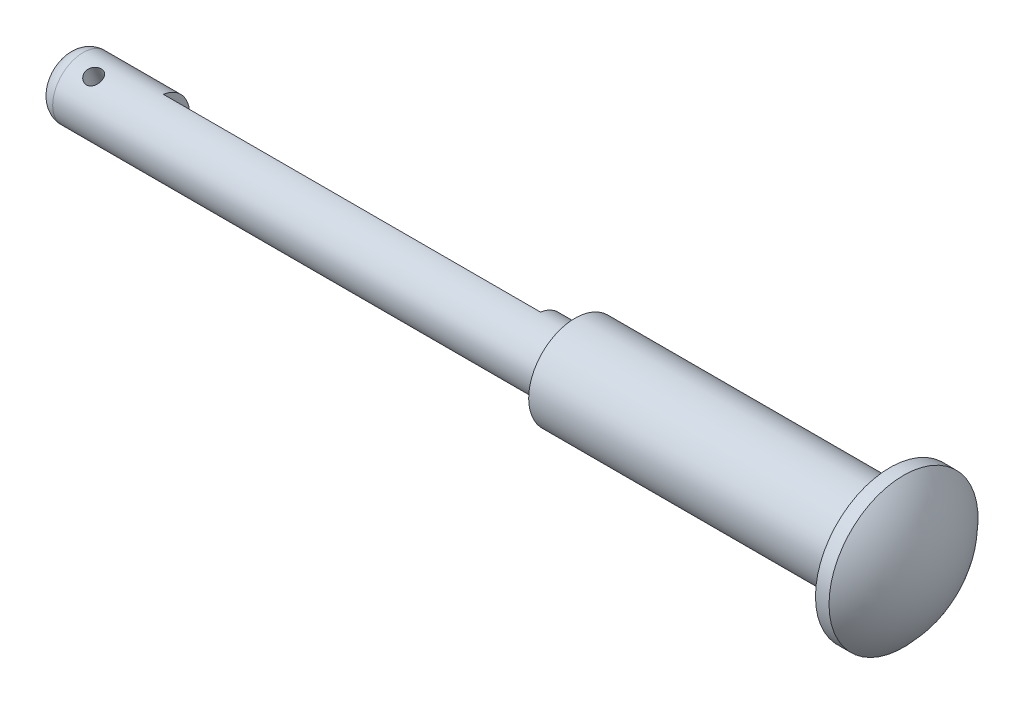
from build123d import *

# Parameters (mm, degrees)
ENL_V_MAT_EXTRU_1_DEPTH      = 10
ENL_V_MAT_EXTRU_1_DEPTH_BACK = 122.183822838
ESQUISSE3_R                  = 0.5
ESQUISSE5_W                  = 23.278549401
ESQUISSE5_H                  = 5.524970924
ENL_V_MAT_EXTRU_3_DEPTH      = 176.759889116
CONG_1_R                     = 1


with BuildPart() as part:
    # Esquisse1 → Base-R_volution (revolve)
    with BuildSketch(Plane.XY, mode=Mode.PRIVATE) as base_r_volution_sk:
        with BuildLine():
            Line((-100, 151.804700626), (-46.459045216, 151.804700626))
            ThreePointArc((-46.459045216, 151.804700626), (-46.954201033, 154.29401702), (-48.364285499, 156.404357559))
            Line((-48.364285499, 156.404357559), (-49.20058676, 156.404357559))
            Line((-49.20058676, 156.404357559), (-49.20058676, 154.662063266))
            Line((-49.20058676, 154.662063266), (-68.644591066, 154.662063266))
            Line((-68.644591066, 154.662063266), (-68.644591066, 153.686378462))
            Line((-68.644591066, 153.686378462), (-100, 153.686378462))
            Line((-100, 153.686378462), (-100, 151.804700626))
        make_face()
    revolve(base_r_volution_sk.sketch.rotate(Axis((-100, 151.804700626, 0), (1, 0, 0)), 90), axis=Axis((-100, 151.804700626, 0), (1, 0, 0)))

    # Esquisse3 → Enl_v. mat.-Extru.1 (cut, two sides: drawn at the far end of the back side and taken through both)
    with BuildSketch(Plane(origin=(0, 126.2129241, 56.833202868), x_dir=(-1, 0, 0), z_dir=(0, 0.9118204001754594, 0.4105892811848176)).offset(-ENL_V_MAT_EXTRU_1_DEPTH_BACK)):
        with Locations(Location((97.590463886, -62.329382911, 0), (0, 0, 90))):
            Circle(ESQUISSE3_R)
    extrude(amount=ENL_V_MAT_EXTRU_1_DEPTH + ENL_V_MAT_EXTRU_1_DEPTH_BACK, mode=Mode.SUBTRACT)

    # Esquisse5 → Enl_v. mat.-Extru.3 (cut, through all)
    with BuildSketch(Plane(origin=(0, 26.002365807, -57.745023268), x_dir=(-1, 0, 0), z_dir=(0, 0.4105892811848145, -0.9118204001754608))):
        with Locations((82.670299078, 138.445309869)):
            Rectangle(ESQUISSE5_W, ESQUISSE5_H)
    extrude(amount=ENL_V_MAT_EXTRU_3_DEPTH, mode=Mode.SUBTRACT)

    # Cong_1
    cong_1_edges = [part.edges().sort_by_distance(p)[0] for p in [
        (-100, 151.804700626, -1.881677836),
    ]]
    fillet(cong_1_edges, radius=CONG_1_R)


solid = part.part
